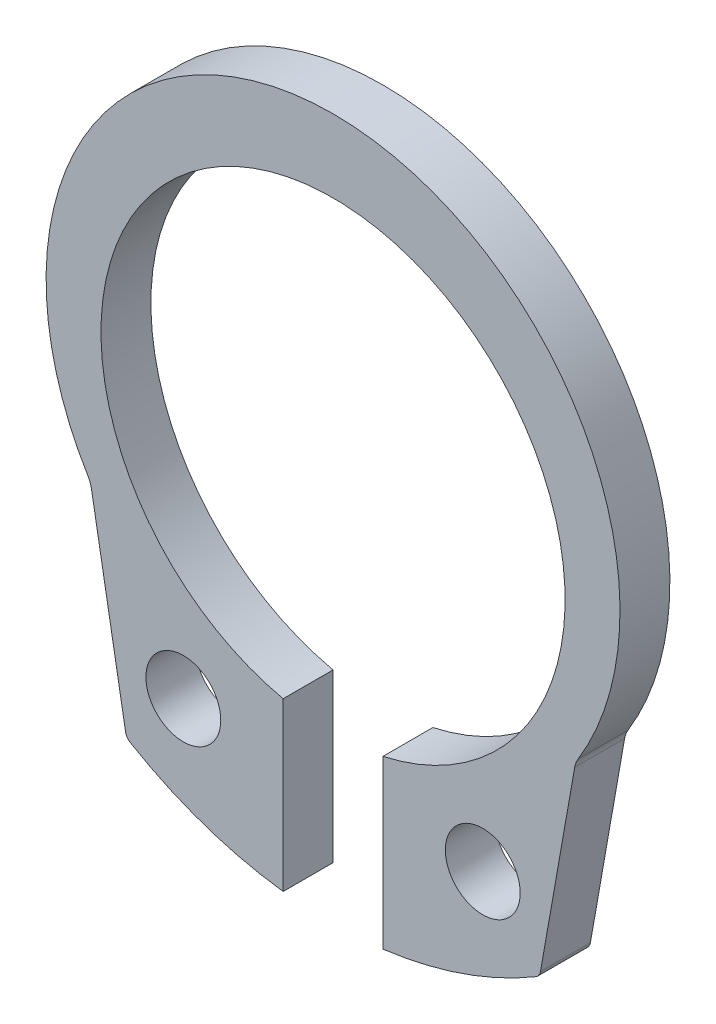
ISO-10303-21;
HEADER;
FILE_DESCRIPTION(('STEP AP214'),'2;1');
FILE_NAME('part.step','',(''),(''),'','','');
FILE_SCHEMA(('AUTOMOTIVE_DESIGN { 1 0 10303 214 1 1 1 1 }'));
ENDSEC;
DATA;
#1=APPLICATION_CONTEXT('core data for automotive mechanical design processes');
#2=APPLICATION_PROTOCOL_DEFINITION('international standard','automotive_design',2000,#1);
#3=PRODUCT_CONTEXT('',#1,'mechanical');
#4=PRODUCT('Part','Part','',(#3));
#5=PRODUCT_RELATED_PRODUCT_CATEGORY('part','',(#4));
#6=PRODUCT_DEFINITION_FORMATION('','',#4);
#7=PRODUCT_DEFINITION_CONTEXT('part definition',#1,'design');
#8=PRODUCT_DEFINITION('design','',#6,#7);
#9=PRODUCT_DEFINITION_SHAPE('','',#8);
#10=(LENGTH_UNIT() NAMED_UNIT(*) SI_UNIT(.MILLI.,.METRE.));
#11=(NAMED_UNIT(*) PLANE_ANGLE_UNIT() SI_UNIT($,.RADIAN.));
#12=(NAMED_UNIT(*) SI_UNIT($,.STERADIAN.) SOLID_ANGLE_UNIT());
#13=UNCERTAINTY_MEASURE_WITH_UNIT(LENGTH_MEASURE(1.E-05),#10,'distance_accuracy_value','');
#14=(GEOMETRIC_REPRESENTATION_CONTEXT(3) GLOBAL_UNCERTAINTY_ASSIGNED_CONTEXT((#13)) GLOBAL_UNIT_ASSIGNED_CONTEXT((#10,
#11,#12)) REPRESENTATION_CONTEXT('',''));
#15=CARTESIAN_POINT('',(0.,0.,0.));
#16=DIRECTION('',(0.,0.,1.));
#17=DIRECTION('',(1.,0.,0.));
#18=AXIS2_PLACEMENT_3D('',#15,#16,#17);
#19=CARTESIAN_POINT('',(0.,-0.359999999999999,-1.));
#20=DIRECTION('',(0.,0.,1.));
#21=DIRECTION('',(1.,0.,0.));
#22=AXIS2_PLACEMENT_3D('',#19,#20,#21);
#23=CYLINDRICAL_SURFACE('',#22,7.95);
#24=CARTESIAN_POINT('',(0.,-0.359999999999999,-1.));
#25=DIRECTION('',(0.,0.,1.));
#26=DIRECTION('',(-1.,0.,0.));
#27=AXIS2_PLACEMENT_3D('',#24,#25,#26);
#28=CIRCLE('',#27,7.95);
#29=CARTESIAN_POINT('',(1.,-8.2468561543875,-1.));
#30=VERTEX_POINT('',#29);
#31=CARTESIAN_POINT('',(4.06204795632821,-7.19390564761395,-1.));
#32=VERTEX_POINT('',#31);
#33=EDGE_CURVE('E174',#30,#32,#28,.T.);
#34=ORIENTED_EDGE('',*,*,#33,.T.);
#35=DIRECTION('',(0.,0.,1.));
#36=VECTOR('',#35,1.);
#37=CARTESIAN_POINT('',(4.06204795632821,-7.19390564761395,-1.));
#38=LINE('',#37,#36);
#39=CARTESIAN_POINT('',(4.06204795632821,-7.19390564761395,0.));
#40=VERTEX_POINT('',#39);
#41=EDGE_CURVE('E192',#32,#40,#38,.T.);
#42=ORIENTED_EDGE('',*,*,#41,.T.);
#43=CARTESIAN_POINT('',(0.,-0.359999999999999,0.));
#44=DIRECTION('',(0.,0.,1.));
#45=DIRECTION('',(-1.,0.,0.));
#46=AXIS2_PLACEMENT_3D('',#43,#44,#45);
#47=CIRCLE('',#46,7.95);
#48=CARTESIAN_POINT('',(1.,-8.2468561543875,0.));
#49=VERTEX_POINT('',#48);
#50=EDGE_CURVE('E154',#49,#40,#47,.T.);
#51=ORIENTED_EDGE('',*,*,#50,.F.);
#52=DIRECTION('',(0.,0.,1.));
#53=VECTOR('',#52,1.);
#54=CARTESIAN_POINT('',(1.,-8.2468561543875,-1.));
#55=LINE('',#54,#53);
#56=EDGE_CURVE('E175',#30,#49,#55,.T.);
#57=ORIENTED_EDGE('',*,*,#56,.F.);
#58=EDGE_LOOP('',(#34,#42,#51,#57));
#59=FACE_BOUND('',#58,.T.);
#60=ADVANCED_FACE('F33',(#59),#23,.T.);
#61=CARTESIAN_POINT('',(1.,-4.90120028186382,-1.));
#62=DIRECTION('',(-1.,0.,0.));
#63=DIRECTION('',(0.,-1.,0.));
#64=AXIS2_PLACEMENT_3D('',#61,#62,#63);
#65=PLANE('',#64);
#66=DIRECTION('',(0.,-1.,0.));
#67=VECTOR('',#66,1.);
#68=CARTESIAN_POINT('',(1.,-4.90120028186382,0.));
#69=LINE('',#68,#67);
#70=CARTESIAN_POINT('',(1.,-4.90120028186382,0.));
#71=VERTEX_POINT('',#70);
#72=EDGE_CURVE('E171',#71,#49,#69,.T.);
#73=ORIENTED_EDGE('',*,*,#72,.F.);
#74=DIRECTION('',(0.,0.,1.));
#75=VECTOR('',#74,1.);
#76=CARTESIAN_POINT('',(1.,-4.90120028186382,-1.));
#77=LINE('',#76,#75);
#78=CARTESIAN_POINT('',(1.,-4.90120028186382,-1.));
#79=VERTEX_POINT('',#78);
#80=EDGE_CURVE('E178',#79,#71,#77,.T.);
#81=ORIENTED_EDGE('',*,*,#80,.F.);
#82=DIRECTION('',(0.,-1.,0.));
#83=VECTOR('',#82,1.);
#84=CARTESIAN_POINT('',(1.,-4.90120028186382,-1.));
#85=LINE('',#84,#83);
#86=EDGE_CURVE('E141',#79,#30,#85,.T.);
#87=ORIENTED_EDGE('',*,*,#86,.T.);
#88=ORIENTED_EDGE('',*,*,#56,.T.);
#89=EDGE_LOOP('',(#73,#81,#87,#88));
#90=FACE_BOUND('',#89,.T.);
#91=ADVANCED_FACE('F273',(#90),#65,.T.);
#92=CARTESIAN_POINT('',(0.,-0.36,-1.));
#93=DIRECTION('',(0.,0.,1.));
#94=DIRECTION('',(1.,0.,0.));
#95=AXIS2_PLACEMENT_3D('',#92,#93,#94);
#96=CYLINDRICAL_SURFACE('',#95,4.65);
#97=CARTESIAN_POINT('',(0.,-0.36,0.));
#98=DIRECTION('',(0.,0.,-1.));
#99=DIRECTION('',(1.,0.,0.));
#100=AXIS2_PLACEMENT_3D('',#97,#98,#99);
#101=CIRCLE('',#100,4.65);
#102=CARTESIAN_POINT('',(-1.,-4.90120028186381,0.));
#103=VERTEX_POINT('',#102);
#104=EDGE_CURVE('E168',#103,#71,#101,.T.);
#105=ORIENTED_EDGE('',*,*,#104,.F.);
#106=DIRECTION('',(0.,0.,1.));
#107=VECTOR('',#106,1.);
#108=CARTESIAN_POINT('',(-1.,-4.90120028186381,-1.));
#109=LINE('',#108,#107);
#110=CARTESIAN_POINT('',(-1.,-4.90120028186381,-1.));
#111=VERTEX_POINT('',#110);
#112=EDGE_CURVE('E140',#111,#103,#109,.T.);
#113=ORIENTED_EDGE('',*,*,#112,.F.);
#114=CARTESIAN_POINT('',(0.,-0.36,-1.));
#115=DIRECTION('',(0.,0.,-1.));
#116=DIRECTION('',(1.,0.,0.));
#117=AXIS2_PLACEMENT_3D('',#114,#115,#116);
#118=CIRCLE('',#117,4.65);
#119=EDGE_CURVE('E147',#111,#79,#118,.T.);
#120=ORIENTED_EDGE('',*,*,#119,.T.);
#121=ORIENTED_EDGE('',*,*,#80,.T.);
#122=EDGE_LOOP('',(#105,#113,#120,#121));
#123=FACE_BOUND('',#122,.T.);
#124=ADVANCED_FACE('F279',(#123),#96,.F.);
#125=CARTESIAN_POINT('',(-1.,-4.90120028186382,-1.));
#126=DIRECTION('',(1.,0.,0.));
#127=DIRECTION('',(0.,1.,0.));
#128=AXIS2_PLACEMENT_3D('',#125,#126,#127);
#129=PLANE('',#128);
#130=DIRECTION('',(0.,1.,0.));
#131=VECTOR('',#130,1.);
#132=CARTESIAN_POINT('',(-1.,-4.90120028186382,0.));
#133=LINE('',#132,#131);
#134=CARTESIAN_POINT('',(-1.,-8.2468561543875,0.));
#135=VERTEX_POINT('',#134);
#136=EDGE_CURVE('E139',#135,#103,#133,.T.);
#137=ORIENTED_EDGE('',*,*,#136,.F.);
#138=DIRECTION('',(0.,0.,1.));
#139=VECTOR('',#138,1.);
#140=CARTESIAN_POINT('',(-1.,-8.2468561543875,-1.));
#141=LINE('',#140,#139);
#142=CARTESIAN_POINT('',(-1.,-8.2468561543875,-1.));
#143=VERTEX_POINT('',#142);
#144=EDGE_CURVE('E124',#143,#135,#141,.T.);
#145=ORIENTED_EDGE('',*,*,#144,.F.);
#146=DIRECTION('',(0.,1.,0.));
#147=VECTOR('',#146,1.);
#148=CARTESIAN_POINT('',(-1.,-4.90120028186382,-1.));
#149=LINE('',#148,#147);
#150=EDGE_CURVE('E132',#143,#111,#149,.T.);
#151=ORIENTED_EDGE('',*,*,#150,.T.);
#152=ORIENTED_EDGE('',*,*,#112,.T.);
#153=EDGE_LOOP('',(#137,#145,#151,#152));
#154=FACE_BOUND('',#153,.T.);
#155=ADVANCED_FACE('F137',(#154),#129,.T.);
#156=CARTESIAN_POINT('',(0.,-0.359999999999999,-1.));
#157=DIRECTION('',(0.,0.,1.));
#158=DIRECTION('',(1.,0.,0.));
#159=AXIS2_PLACEMENT_3D('',#156,#157,#158);
#160=CYLINDRICAL_SURFACE('',#159,7.95);
#161=CARTESIAN_POINT('',(0.,-0.359999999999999,0.));
#162=DIRECTION('',(0.,0.,1.));
#163=DIRECTION('',(1.,0.,0.));
#164=AXIS2_PLACEMENT_3D('',#161,#162,#163);
#165=CIRCLE('',#164,7.95);
#166=CARTESIAN_POINT('',(-4.06204795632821,-7.19390564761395,0.));
#167=VERTEX_POINT('',#166);
#168=EDGE_CURVE('E165',#167,#135,#165,.T.);
#169=ORIENTED_EDGE('',*,*,#168,.F.);
#170=DIRECTION('',(0.,0.,1.));
#171=VECTOR('',#170,1.);
#172=CARTESIAN_POINT('',(-4.06204795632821,-7.19390564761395,-1.));
#173=LINE('',#172,#171);
#174=CARTESIAN_POINT('',(-4.06204795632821,-7.19390564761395,-1.));
#175=VERTEX_POINT('',#174);
#176=EDGE_CURVE('E127',#167,#175,#173,.F.);
#177=ORIENTED_EDGE('',*,*,#176,.T.);
#178=CARTESIAN_POINT('',(0.,-0.359999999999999,-1.));
#179=DIRECTION('',(0.,0.,1.));
#180=DIRECTION('',(1.,0.,0.));
#181=AXIS2_PLACEMENT_3D('',#178,#179,#180);
#182=CIRCLE('',#181,7.95);
#183=EDGE_CURVE('E120',#175,#143,#182,.T.);
#184=ORIENTED_EDGE('',*,*,#183,.T.);
#185=ORIENTED_EDGE('',*,*,#144,.T.);
#186=EDGE_LOOP('',(#169,#177,#184,#185));
#187=FACE_BOUND('',#186,.T.);
#188=ADVANCED_FACE('F123',(#187),#160,.T.);
#189=CARTESIAN_POINT('',(-4.85898512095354,-3.07453469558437,-1.));
#190=DIRECTION('',(-0.984807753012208,-0.173648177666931,0.));
#191=DIRECTION('',(0.173648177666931,-0.984807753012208,0.));
#192=AXIS2_PLACEMENT_3D('',#189,#190,#191);
#193=PLANE('',#192);
#194=DIRECTION('',(0.173648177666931,-0.984807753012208,0.));
#195=VECTOR('',#194,1.);
#196=CARTESIAN_POINT('',(-4.85898512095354,-3.07453469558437,0.));
#197=LINE('',#196,#195);
#198=CARTESIAN_POINT('',(-4.84222394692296,-3.16959203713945,0.));
#199=VERTEX_POINT('',#198);
#200=CARTESIAN_POINT('',(-4.15681962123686,-7.05671312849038,0.));
#201=VERTEX_POINT('',#200);
#202=EDGE_CURVE('E163',#199,#201,#197,.T.);
#203=ORIENTED_EDGE('',*,*,#202,.F.);
#204=DIRECTION('',(0.,0.,-1.));
#205=VECTOR('',#204,1.);
#206=CARTESIAN_POINT('',(-4.84222394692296,-3.16959203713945,-1.));
#207=LINE('',#206,#205);
#208=CARTESIAN_POINT('',(-4.84222394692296,-3.16959203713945,-1.));
#209=VERTEX_POINT('',#208);
#210=EDGE_CURVE('E54',#199,#209,#207,.T.);
#211=ORIENTED_EDGE('',*,*,#210,.T.);
#212=DIRECTION('',(0.173648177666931,-0.984807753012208,0.));
#213=VECTOR('',#212,1.);
#214=CARTESIAN_POINT('',(-4.85898512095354,-3.07453469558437,-1.));
#215=LINE('',#214,#213);
#216=CARTESIAN_POINT('',(-4.15681962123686,-7.05671312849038,-1.));
#217=VERTEX_POINT('',#216);
#218=EDGE_CURVE('E133',#209,#217,#215,.T.);
#219=ORIENTED_EDGE('',*,*,#218,.T.);
#220=DIRECTION('',(0.,0.,1.));
#221=VECTOR('',#220,1.);
#222=CARTESIAN_POINT('',(-4.15681962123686,-7.05671312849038,-1.));
#223=LINE('',#222,#221);
#224=EDGE_CURVE('E177',#217,#201,#223,.T.);
#225=ORIENTED_EDGE('',*,*,#224,.T.);
#226=EDGE_LOOP('',(#203,#211,#219,#225));
#227=FACE_BOUND('',#226,.T.);
#228=ADVANCED_FACE('F332',(#227),#193,.T.);
#229=CARTESIAN_POINT('',(0.,0.,-1.));
#230=DIRECTION('',(0.,0.,1.));
#231=DIRECTION('',(1.,0.,0.));
#232=AXIS2_PLACEMENT_3D('',#229,#230,#231);
#233=CYLINDRICAL_SURFACE('',#232,5.75);
#234=CARTESIAN_POINT('',(0.,0.,0.));
#235=DIRECTION('',(0.,0.,1.));
#236=DIRECTION('',(1.,0.,0.));
#237=AXIS2_PLACEMENT_3D('',#234,#235,#236);
#238=CIRCLE('',#237,5.75);
#239=CARTESIAN_POINT('',(4.90785759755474,-2.99590283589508,0.));
#240=VERTEX_POINT('',#239);
#241=CARTESIAN_POINT('',(-4.90785759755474,-2.99590283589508,0.));
#242=VERTEX_POINT('',#241);
#243=EDGE_CURVE('E161',#240,#242,#238,.T.);
#244=ORIENTED_EDGE('',*,*,#243,.F.);
#245=DIRECTION('',(0.,0.,1.));
#246=VECTOR('',#245,1.);
#247=CARTESIAN_POINT('',(4.90785759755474,-2.99590283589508,-1.));
#248=LINE('',#247,#246);
#249=CARTESIAN_POINT('',(4.90785759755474,-2.99590283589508,-1.));
#250=VERTEX_POINT('',#249);
#251=EDGE_CURVE('E203',#240,#250,#248,.F.);
#252=ORIENTED_EDGE('',*,*,#251,.T.);
#253=CARTESIAN_POINT('',(0.,0.,-1.));
#254=DIRECTION('',(0.,0.,1.));
#255=DIRECTION('',(1.,0.,0.));
#256=AXIS2_PLACEMENT_3D('',#253,#254,#255);
#257=CIRCLE('',#256,5.75);
#258=CARTESIAN_POINT('',(-4.90785759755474,-2.99590283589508,-1.));
#259=VERTEX_POINT('',#258);
#260=EDGE_CURVE('E216',#250,#259,#257,.T.);
#261=ORIENTED_EDGE('',*,*,#260,.T.);
#262=DIRECTION('',(0.,0.,1.));
#263=VECTOR('',#262,1.);
#264=CARTESIAN_POINT('',(-4.90785759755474,-2.99590283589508,-1.));
#265=LINE('',#264,#263);
#266=EDGE_CURVE('E200',#259,#242,#265,.T.);
#267=ORIENTED_EDGE('',*,*,#266,.T.);
#268=EDGE_LOOP('',(#244,#252,#261,#267));
#269=FACE_BOUND('',#268,.T.);
#270=ADVANCED_FACE('F229',(#269),#233,.T.);
#271=CARTESIAN_POINT('',(4.85898512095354,-3.07453469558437,-1.));
#272=DIRECTION('',(0.984807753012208,-0.173648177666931,0.));
#273=DIRECTION('',(0.173648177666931,0.984807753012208,0.));
#274=AXIS2_PLACEMENT_3D('',#271,#272,#273);
#275=PLANE('',#274);
#276=DIRECTION('',(0.173648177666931,0.984807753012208,0.));
#277=VECTOR('',#276,1.);
#278=CARTESIAN_POINT('',(4.85898512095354,-3.07453469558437,-1.));
#279=LINE('',#278,#277);
#280=CARTESIAN_POINT('',(4.15681962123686,-7.05671312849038,-1.));
#281=VERTEX_POINT('',#280);
#282=CARTESIAN_POINT('',(4.84222394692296,-3.16959203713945,-1.));
#283=VERTEX_POINT('',#282);
#284=EDGE_CURVE('E213',#281,#283,#279,.T.);
#285=ORIENTED_EDGE('',*,*,#284,.T.);
#286=DIRECTION('',(0.,0.,-1.));
#287=VECTOR('',#286,1.);
#288=CARTESIAN_POINT('',(4.84222394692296,-3.16959203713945,0.));
#289=LINE('',#288,#287);
#290=CARTESIAN_POINT('',(4.84222394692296,-3.16959203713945,0.));
#291=VERTEX_POINT('',#290);
#292=EDGE_CURVE('E197',#283,#291,#289,.F.);
#293=ORIENTED_EDGE('',*,*,#292,.T.);
#294=DIRECTION('',(0.173648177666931,0.984807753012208,0.));
#295=VECTOR('',#294,1.);
#296=CARTESIAN_POINT('',(4.85898512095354,-3.07453469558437,0.));
#297=LINE('',#296,#295);
#298=CARTESIAN_POINT('',(4.15681962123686,-7.05671312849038,0.));
#299=VERTEX_POINT('',#298);
#300=EDGE_CURVE('E157',#299,#291,#297,.T.);
#301=ORIENTED_EDGE('',*,*,#300,.F.);
#302=DIRECTION('',(0.,0.,1.));
#303=VECTOR('',#302,1.);
#304=CARTESIAN_POINT('',(4.15681962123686,-7.05671312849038,-1.));
#305=LINE('',#304,#303);
#306=EDGE_CURVE('E195',#299,#281,#305,.F.);
#307=ORIENTED_EDGE('',*,*,#306,.T.);
#308=EDGE_LOOP('',(#285,#293,#301,#307));
#309=FACE_BOUND('',#308,.T.);
#310=ADVANCED_FACE('F221',(#309),#275,.T.);
#311=CARTESIAN_POINT('',(0.,-0.359999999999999,-1.));
#312=DIRECTION('',(0.,0.,-1.));
#313=DIRECTION('',(-1.,0.,0.));
#314=AXIS2_PLACEMENT_3D('',#311,#312,#313);
#315=PLANE('',#314);
#316=CARTESIAN_POINT('',(3.,-5.89985559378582,-1.));
#317=DIRECTION('',(0.,0.,1.));
#318=DIRECTION('',(-1.,0.,0.));
#319=AXIS2_PLACEMENT_3D('',#316,#317,#318);
#320=CIRCLE('',#319,0.75);
#321=CARTESIAN_POINT('',(2.25,-5.89985559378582,-1.));
#322=VERTEX_POINT('',#321);
#323=EDGE_CURVE('E241',#322,#322,#320,.T.);
#324=ORIENTED_EDGE('',*,*,#323,.T.);
#325=EDGE_LOOP('',(#324));
#326=FACE_BOUND('',#325,.T.);
#327=CARTESIAN_POINT('',(-3.,-5.89985559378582,-1.));
#328=DIRECTION('',(0.,0.,1.));
#329=DIRECTION('',(1.,0.,0.));
#330=AXIS2_PLACEMENT_3D('',#327,#328,#329);
#331=CIRCLE('',#330,0.75);
#332=CARTESIAN_POINT('',(-2.25,-5.89985559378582,-1.));
#333=VERTEX_POINT('',#332);
#334=EDGE_CURVE('E158',#333,#333,#331,.T.);
#335=ORIENTED_EDGE('',*,*,#334,.T.);
#336=EDGE_LOOP('',(#335));
#337=FACE_BOUND('',#336,.T.);
#338=ORIENTED_EDGE('',*,*,#183,.F.);
#339=CARTESIAN_POINT('',(-3.95985807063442,-7.021983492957,-1.));
#340=DIRECTION('',(0.,0.,-1.));
#341=DIRECTION('',(-1.,0.,0.));
#342=AXIS2_PLACEMENT_3D('',#339,#340,#341);
#343=CIRCLE('',#342,0.2);
#344=EDGE_CURVE('E190',#175,#217,#343,.T.);
#345=ORIENTED_EDGE('',*,*,#344,.T.);
#346=ORIENTED_EDGE('',*,*,#218,.F.);
#347=CARTESIAN_POINT('',(-5.33462782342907,-3.25641612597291,-1.));
#348=DIRECTION('',(0.,0.,-1.));
#349=DIRECTION('',(-1.,0.,0.));
#350=AXIS2_PLACEMENT_3D('',#347,#348,#349);
#351=CIRCLE('',#350,0.5);
#352=EDGE_CURVE('E11',#209,#259,#351,.F.);
#353=ORIENTED_EDGE('',*,*,#352,.T.);
#354=ORIENTED_EDGE('',*,*,#260,.F.);
#355=CARTESIAN_POINT('',(5.33462782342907,-3.25641612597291,-1.));
#356=DIRECTION('',(0.,0.,-1.));
#357=DIRECTION('',(-1.,0.,0.));
#358=AXIS2_PLACEMENT_3D('',#355,#356,#357);
#359=CIRCLE('',#358,0.5);
#360=EDGE_CURVE('E208',#250,#283,#359,.F.);
#361=ORIENTED_EDGE('',*,*,#360,.T.);
#362=ORIENTED_EDGE('',*,*,#284,.F.);
#363=CARTESIAN_POINT('',(3.95985807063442,-7.021983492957,-1.));
#364=DIRECTION('',(0.,0.,-1.));
#365=DIRECTION('',(-1.,0.,0.));
#366=AXIS2_PLACEMENT_3D('',#363,#364,#365);
#367=CIRCLE('',#366,0.2);
#368=EDGE_CURVE('E188',#281,#32,#367,.T.);
#369=ORIENTED_EDGE('',*,*,#368,.T.);
#370=ORIENTED_EDGE('',*,*,#33,.F.);
#371=ORIENTED_EDGE('',*,*,#86,.F.);
#372=ORIENTED_EDGE('',*,*,#119,.F.);
#373=ORIENTED_EDGE('',*,*,#150,.F.);
#374=EDGE_LOOP('',(#338,#345,#346,#353,#354,#361,#362,#369,#370,#371,#372,#373));
#375=FACE_BOUND('',#374,.T.);
#376=ADVANCED_FACE('F144',(#326,#337,#375),#315,.T.);
#377=CARTESIAN_POINT('',(0.,-0.359999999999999,0.));
#378=DIRECTION('',(0.,0.,-1.));
#379=DIRECTION('',(-1.,0.,0.));
#380=AXIS2_PLACEMENT_3D('',#377,#378,#379);
#381=PLANE('',#380);
#382=CARTESIAN_POINT('',(3.,-5.89985559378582,0.));
#383=DIRECTION('',(0.,0.,1.));
#384=DIRECTION('',(-1.,0.,0.));
#385=AXIS2_PLACEMENT_3D('',#382,#383,#384);
#386=CIRCLE('',#385,0.75);
#387=CARTESIAN_POINT('',(2.25,-5.89985559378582,0.));
#388=VERTEX_POINT('',#387);
#389=EDGE_CURVE('E244',#388,#388,#386,.T.);
#390=ORIENTED_EDGE('',*,*,#389,.F.);
#391=EDGE_LOOP('',(#390));
#392=FACE_BOUND('',#391,.T.);
#393=CARTESIAN_POINT('',(-3.,-5.89985559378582,0.));
#394=DIRECTION('',(0.,0.,1.));
#395=DIRECTION('',(1.,0.,0.));
#396=AXIS2_PLACEMENT_3D('',#393,#394,#395);
#397=CIRCLE('',#396,0.75);
#398=CARTESIAN_POINT('',(-2.25,-5.89985559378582,0.));
#399=VERTEX_POINT('',#398);
#400=EDGE_CURVE('E238',#399,#399,#397,.T.);
#401=ORIENTED_EDGE('',*,*,#400,.F.);
#402=EDGE_LOOP('',(#401));
#403=FACE_BOUND('',#402,.T.);
#404=ORIENTED_EDGE('',*,*,#243,.T.);
#405=CARTESIAN_POINT('',(-5.33462782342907,-3.25641612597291,0.));
#406=DIRECTION('',(0.,0.,-1.));
#407=DIRECTION('',(-1.,0.,0.));
#408=AXIS2_PLACEMENT_3D('',#405,#406,#407);
#409=CIRCLE('',#408,0.5);
#410=EDGE_CURVE('E41',#242,#199,#409,.T.);
#411=ORIENTED_EDGE('',*,*,#410,.T.);
#412=ORIENTED_EDGE('',*,*,#202,.T.);
#413=CARTESIAN_POINT('',(-3.95985807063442,-7.021983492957,0.));
#414=DIRECTION('',(0.,0.,-1.));
#415=DIRECTION('',(-1.,0.,0.));
#416=AXIS2_PLACEMENT_3D('',#413,#414,#415);
#417=CIRCLE('',#416,0.2);
#418=EDGE_CURVE('E185',#201,#167,#417,.F.);
#419=ORIENTED_EDGE('',*,*,#418,.T.);
#420=ORIENTED_EDGE('',*,*,#168,.T.);
#421=ORIENTED_EDGE('',*,*,#136,.T.);
#422=ORIENTED_EDGE('',*,*,#104,.T.);
#423=ORIENTED_EDGE('',*,*,#72,.T.);
#424=ORIENTED_EDGE('',*,*,#50,.T.);
#425=CARTESIAN_POINT('',(3.95985807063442,-7.021983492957,0.));
#426=DIRECTION('',(0.,0.,-1.));
#427=DIRECTION('',(-1.,0.,0.));
#428=AXIS2_PLACEMENT_3D('',#425,#426,#427);
#429=CIRCLE('',#428,0.2);
#430=EDGE_CURVE('E183',#40,#299,#429,.F.);
#431=ORIENTED_EDGE('',*,*,#430,.T.);
#432=ORIENTED_EDGE('',*,*,#300,.T.);
#433=CARTESIAN_POINT('',(5.33462782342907,-3.25641612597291,0.));
#434=DIRECTION('',(0.,0.,-1.));
#435=DIRECTION('',(-1.,0.,0.));
#436=AXIS2_PLACEMENT_3D('',#433,#434,#435);
#437=CIRCLE('',#436,0.5);
#438=EDGE_CURVE('E206',#291,#240,#437,.T.);
#439=ORIENTED_EDGE('',*,*,#438,.T.);
#440=EDGE_LOOP('',(#404,#411,#412,#419,#420,#421,#422,#423,#424,#431,#432,#439));
#441=FACE_BOUND('',#440,.T.);
#442=ADVANCED_FACE('F227',(#392,#403,#441),#381,.F.);
#443=CARTESIAN_POINT('',(-3.,-5.89985559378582,-1.));
#444=DIRECTION('',(0.,0.,1.));
#445=DIRECTION('',(1.,0.,0.));
#446=AXIS2_PLACEMENT_3D('',#443,#444,#445);
#447=CYLINDRICAL_SURFACE('',#446,0.75);
#448=ORIENTED_EDGE('',*,*,#334,.F.);
#449=EDGE_LOOP('',(#448));
#450=FACE_BOUND('',#449,.T.);
#451=ORIENTED_EDGE('',*,*,#400,.T.);
#452=EDGE_LOOP('',(#451));
#453=FACE_BOUND('',#452,.T.);
#454=ADVANCED_FACE('F256',(#450,#453),#447,.F.);
#455=CARTESIAN_POINT('',(3.,-5.89985559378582,-1.));
#456=DIRECTION('',(0.,0.,1.));
#457=DIRECTION('',(1.,0.,0.));
#458=AXIS2_PLACEMENT_3D('',#455,#456,#457);
#459=CYLINDRICAL_SURFACE('',#458,0.75);
#460=ORIENTED_EDGE('',*,*,#323,.F.);
#461=EDGE_LOOP('',(#460));
#462=FACE_BOUND('',#461,.T.);
#463=ORIENTED_EDGE('',*,*,#389,.T.);
#464=EDGE_LOOP('',(#463));
#465=FACE_BOUND('',#464,.T.);
#466=ADVANCED_FACE('F252',(#462,#465),#459,.F.);
#467=CARTESIAN_POINT('',(-3.95985807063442,-7.021983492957,-1.));
#468=DIRECTION('',(0.,0.,1.));
#469=DIRECTION('',(1.,0.,0.));
#470=AXIS2_PLACEMENT_3D('',#467,#468,#469);
#471=CYLINDRICAL_SURFACE('',#470,0.2);
#472=ORIENTED_EDGE('',*,*,#344,.F.);
#473=ORIENTED_EDGE('',*,*,#176,.F.);
#474=ORIENTED_EDGE('',*,*,#418,.F.);
#475=ORIENTED_EDGE('',*,*,#224,.F.);
#476=EDGE_LOOP('',(#472,#473,#474,#475));
#477=FACE_BOUND('',#476,.T.);
#478=ADVANCED_FACE('F255',(#477),#471,.T.);
#479=CARTESIAN_POINT('',(3.95985807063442,-7.021983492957,-1.));
#480=DIRECTION('',(0.,0.,1.));
#481=DIRECTION('',(1.,0.,0.));
#482=AXIS2_PLACEMENT_3D('',#479,#480,#481);
#483=CYLINDRICAL_SURFACE('',#482,0.2);
#484=ORIENTED_EDGE('',*,*,#368,.F.);
#485=ORIENTED_EDGE('',*,*,#306,.F.);
#486=ORIENTED_EDGE('',*,*,#430,.F.);
#487=ORIENTED_EDGE('',*,*,#41,.F.);
#488=EDGE_LOOP('',(#484,#485,#486,#487));
#489=FACE_BOUND('',#488,.T.);
#490=ADVANCED_FACE('F287',(#489),#483,.T.);
#491=CARTESIAN_POINT('',(5.33462782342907,-3.25641612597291,-1.));
#492=DIRECTION('',(0.,0.,1.));
#493=DIRECTION('',(1.,0.,0.));
#494=AXIS2_PLACEMENT_3D('',#491,#492,#493);
#495=CYLINDRICAL_SURFACE('',#494,0.5);
#496=ORIENTED_EDGE('',*,*,#360,.F.);
#497=ORIENTED_EDGE('',*,*,#251,.F.);
#498=ORIENTED_EDGE('',*,*,#438,.F.);
#499=ORIENTED_EDGE('',*,*,#292,.F.);
#500=EDGE_LOOP('',(#496,#497,#498,#499));
#501=FACE_BOUND('',#500,.T.);
#502=ADVANCED_FACE('F225',(#501),#495,.F.);
#503=CARTESIAN_POINT('',(-5.33462782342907,-3.25641612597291,-1.));
#504=DIRECTION('',(0.,0.,1.));
#505=DIRECTION('',(1.,0.,0.));
#506=AXIS2_PLACEMENT_3D('',#503,#504,#505);
#507=CYLINDRICAL_SURFACE('',#506,0.5);
#508=ORIENTED_EDGE('',*,*,#352,.F.);
#509=ORIENTED_EDGE('',*,*,#210,.F.);
#510=ORIENTED_EDGE('',*,*,#410,.F.);
#511=ORIENTED_EDGE('',*,*,#266,.F.);
#512=EDGE_LOOP('',(#508,#509,#510,#511));
#513=FACE_BOUND('',#512,.T.);
#514=ADVANCED_FACE('F35',(#513),#507,.F.);
#515=CLOSED_SHELL('',(#60,#91,#124,#155,#188,#228,#270,#310,#376,#442,#454,#466,#478,#490,#502,#514));
#516=MANIFOLD_SOLID_BREP('B2',#515);
#517=ADVANCED_BREP_SHAPE_REPRESENTATION('',(#18,#516),#14);
#518=SHAPE_DEFINITION_REPRESENTATION(#9,#517);
ENDSEC;
END-ISO-10303-21;
